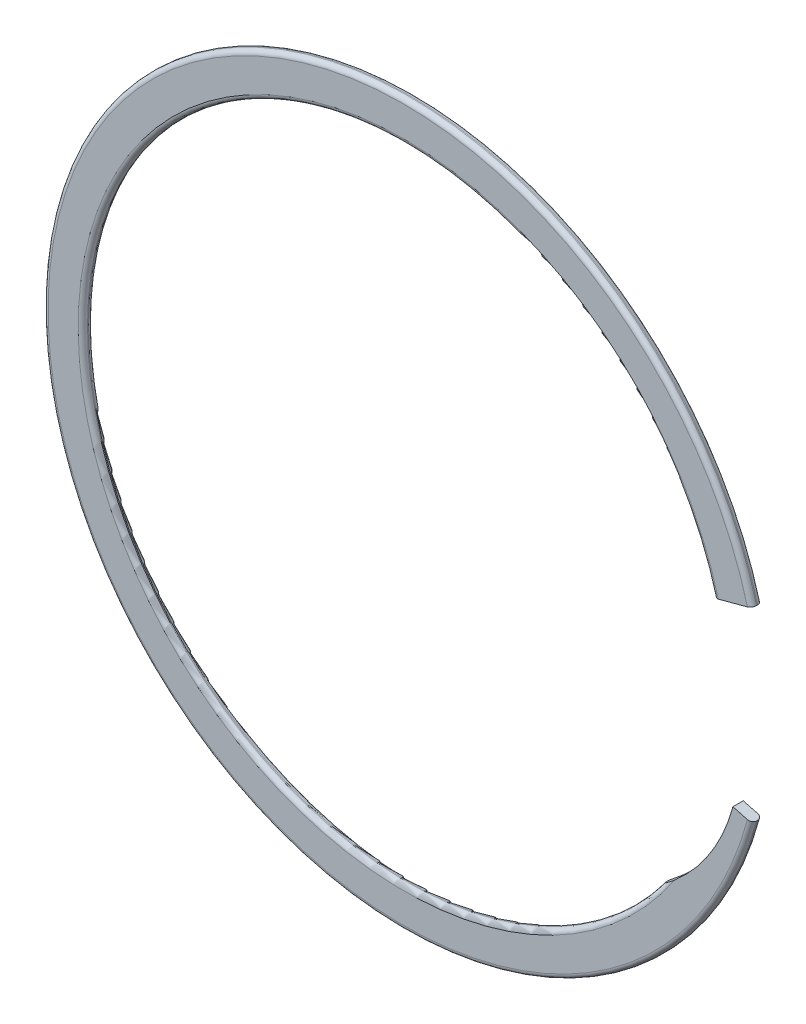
from build123d import *

# Parameters (mm, degrees)
EXTRUDE1_DEPTH = 0.3937
FILLET1_R      = 0.35433


with BuildPart() as part:
    # Sketch2 → Extrude1 (new, symmetric)
    with BuildSketch(Plane.XY):
        with BuildLine():
            Line((25.025206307, -6.705483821), (26.472742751, -7.093350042))
            ThreePointArc((26.472742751, -7.093350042), (-27.4066, 0), (26.472742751, 7.093350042))
            Line((26.472742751, 7.093350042), (23.577669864, 6.3176176))
            ThreePointArc((23.577669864, 6.3176176), (-23.981780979, 4.548954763), (19.626487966, -14.512745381))
            ThreePointArc((19.626487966, -14.512745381), (23.002361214, -11.076923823), (25.025206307, -6.705483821))
        make_face()
    extrude(amount=EXTRUDE1_DEPTH, both=True)

    # Fillet1
    fillet1_edges = [part.edges().sort_by_distance(p)[0] for p in [
        (-27.4066, 0, 0.3937),
        (-23.981780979, 4.548954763, 0.3937),
        (-27.4066, 0, -0.3937),
        (-23.981780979, 4.548954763, -0.3937),
    ]]
    fillet(fillet1_edges, radius=FILLET1_R)


solid = part.part
